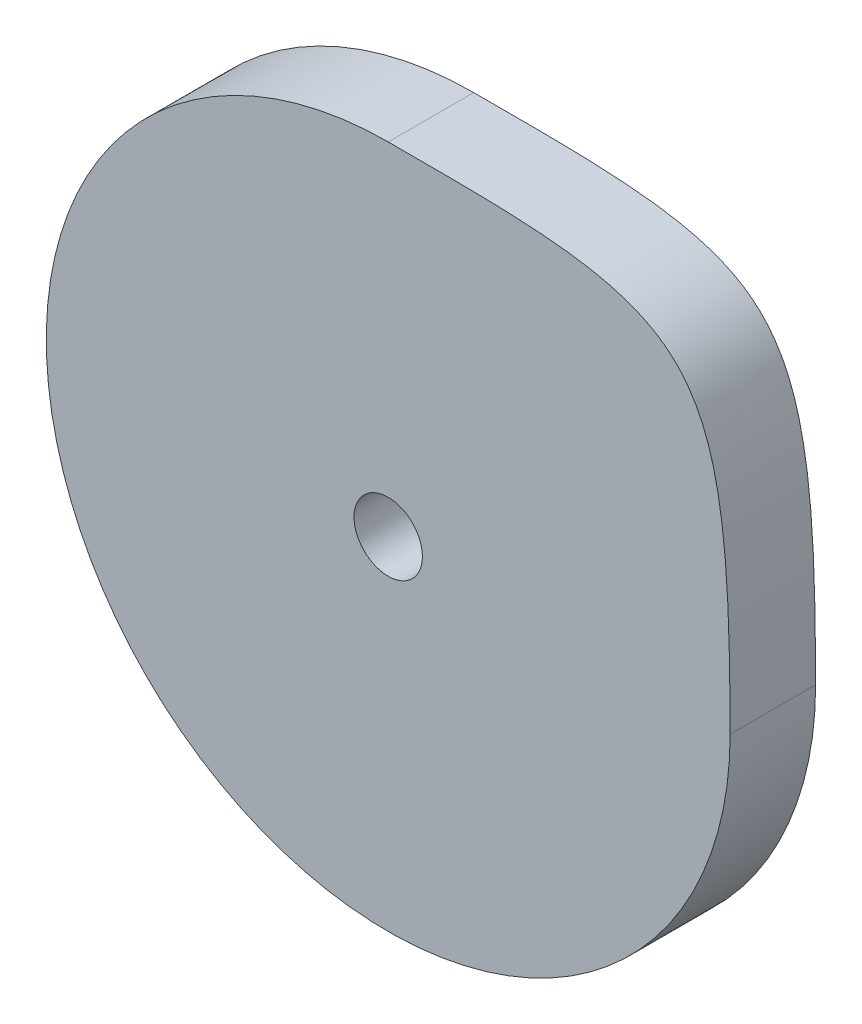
ISO-10303-21;
HEADER;
FILE_DESCRIPTION(('STEP AP214'),'2;1');
FILE_NAME('part.step','',(''),(''),'','','');
FILE_SCHEMA(('AUTOMOTIVE_DESIGN { 1 0 10303 214 1 1 1 1 }'));
ENDSEC;
DATA;
#1=APPLICATION_CONTEXT('core data for automotive mechanical design processes');
#2=APPLICATION_PROTOCOL_DEFINITION('international standard','automotive_design',2000,#1);
#3=PRODUCT_CONTEXT('',#1,'mechanical');
#4=PRODUCT('Part','Part','',(#3));
#5=PRODUCT_RELATED_PRODUCT_CATEGORY('part','',(#4));
#6=PRODUCT_DEFINITION_FORMATION('','',#4);
#7=PRODUCT_DEFINITION_CONTEXT('part definition',#1,'design');
#8=PRODUCT_DEFINITION('design','',#6,#7);
#9=PRODUCT_DEFINITION_SHAPE('','',#8);
#10=(LENGTH_UNIT() NAMED_UNIT(*) SI_UNIT(.MILLI.,.METRE.));
#11=(NAMED_UNIT(*) PLANE_ANGLE_UNIT() SI_UNIT($,.RADIAN.));
#12=(NAMED_UNIT(*) SI_UNIT($,.STERADIAN.) SOLID_ANGLE_UNIT());
#13=UNCERTAINTY_MEASURE_WITH_UNIT(LENGTH_MEASURE(1.E-05),#10,'distance_accuracy_value','');
#14=(GEOMETRIC_REPRESENTATION_CONTEXT(3) GLOBAL_UNCERTAINTY_ASSIGNED_CONTEXT((#13)) GLOBAL_UNIT_ASSIGNED_CONTEXT((#10,
#11,#12)) REPRESENTATION_CONTEXT('',''));
#15=CARTESIAN_POINT('',(0.,0.,0.));
#16=DIRECTION('',(0.,0.,1.));
#17=DIRECTION('',(1.,0.,0.));
#18=AXIS2_PLACEMENT_3D('',#15,#16,#17);
#19=CARTESIAN_POINT('',(32.7692127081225,35.2422942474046,10.));
#20=DIRECTION('',(0.,0.,-1.));
#21=DIRECTION('',(-1.,0.,0.));
#22=AXIS2_PLACEMENT_3D('',#19,#20,#21);
#23=PLANE('',#22);
#24=CARTESIAN_POINT('',(40.,0.,10.));
#25=CARTESIAN_POINT('',(40.,22.2918580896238,10.));
#26=CARTESIAN_POINT('',(37.3343437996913,40.2598451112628,10.));
#27=CARTESIAN_POINT('',(14.1486497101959,40.,10.));
#28=CARTESIAN_POINT('',(0.,40.,10.));
#29=B_SPLINE_CURVE_WITH_KNOTS('',3,(#24,#25,#26,#27,#28),.UNSPECIFIED.,.F.,.F.,(4,1,4),(0.,
0.54697590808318,1.),.UNSPECIFIED.);
#30=CARTESIAN_POINT('',(40.,0.,10.));
#31=VERTEX_POINT('',#30);
#32=CARTESIAN_POINT('',(0.,40.,10.));
#33=VERTEX_POINT('',#32);
#34=EDGE_CURVE('E65',#31,#33,#29,.T.);
#35=ORIENTED_EDGE('',*,*,#34,.T.);
#36=CARTESIAN_POINT('',(0.,0.,10.));
#37=DIRECTION('',(0.,0.,1.));
#38=DIRECTION('',(1.,0.,0.));
#39=AXIS2_PLACEMENT_3D('',#36,#37,#38);
#40=CIRCLE('',#39,40.);
#41=EDGE_CURVE('E50',#33,#31,#40,.T.);
#42=ORIENTED_EDGE('',*,*,#41,.T.);
#43=EDGE_LOOP('',(#35,#42));
#44=FACE_BOUND('',#43,.T.);
#45=CARTESIAN_POINT('',(0.,0.,10.));
#46=DIRECTION('',(0.,0.,1.));
#47=DIRECTION('',(1.,0.,0.));
#48=AXIS2_PLACEMENT_3D('',#45,#46,#47);
#49=CIRCLE('',#48,4.);
#50=CARTESIAN_POINT('',(4.,0.,10.));
#51=VERTEX_POINT('',#50);
#52=EDGE_CURVE('E71',#51,#51,#49,.T.);
#53=ORIENTED_EDGE('',*,*,#52,.F.);
#54=EDGE_LOOP('',(#53));
#55=FACE_BOUND('',#54,.T.);
#56=ADVANCED_FACE('F33',(#44,#55),#23,.F.);
#57=CARTESIAN_POINT('',(32.7692127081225,35.2422942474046,0.));
#58=DIRECTION('',(0.,0.,-1.));
#59=DIRECTION('',(-1.,0.,0.));
#60=AXIS2_PLACEMENT_3D('',#57,#58,#59);
#61=PLANE('',#60);
#62=CARTESIAN_POINT('',(40.,0.,0.));
#63=CARTESIAN_POINT('',(40.,22.2918580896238,0.));
#64=CARTESIAN_POINT('',(37.3343437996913,40.2598451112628,0.));
#65=CARTESIAN_POINT('',(14.1486497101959,40.,0.));
#66=CARTESIAN_POINT('',(0.,40.,0.));
#67=B_SPLINE_CURVE_WITH_KNOTS('',3,(#62,#63,#64,#65,#66),.UNSPECIFIED.,.F.,.F.,(4,1,4),(0.,
0.54697590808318,1.),.UNSPECIFIED.);
#68=CARTESIAN_POINT('',(40.,0.,0.));
#69=VERTEX_POINT('',#68);
#70=CARTESIAN_POINT('',(0.,40.,0.));
#71=VERTEX_POINT('',#70);
#72=EDGE_CURVE('E66',#69,#71,#67,.T.);
#73=ORIENTED_EDGE('',*,*,#72,.F.);
#74=CARTESIAN_POINT('',(0.,0.,0.));
#75=DIRECTION('',(0.,0.,1.));
#76=DIRECTION('',(1.,0.,0.));
#77=AXIS2_PLACEMENT_3D('',#74,#75,#76);
#78=CIRCLE('',#77,40.);
#79=EDGE_CURVE('E58',#71,#69,#78,.T.);
#80=ORIENTED_EDGE('',*,*,#79,.F.);
#81=EDGE_LOOP('',(#73,#80));
#82=FACE_BOUND('',#81,.T.);
#83=CARTESIAN_POINT('',(0.,0.,0.));
#84=DIRECTION('',(0.,0.,1.));
#85=DIRECTION('',(1.,0.,0.));
#86=AXIS2_PLACEMENT_3D('',#83,#84,#85);
#87=CIRCLE('',#86,4.);
#88=CARTESIAN_POINT('',(4.,0.,0.));
#89=VERTEX_POINT('',#88);
#90=EDGE_CURVE('E74',#89,#89,#87,.T.);
#91=ORIENTED_EDGE('',*,*,#90,.T.);
#92=EDGE_LOOP('',(#91));
#93=FACE_BOUND('',#92,.T.);
#94=ADVANCED_FACE('F69',(#82,#93),#61,.T.);
#95=DIRECTION('',(0.,0.,-1.));
#96=VECTOR('',#95,1.);
#97=SURFACE_OF_LINEAR_EXTRUSION('',#29,#96);
#98=ORIENTED_EDGE('',*,*,#72,.T.);
#99=DIRECTION('',(0.,0.,-1.));
#100=VECTOR('',#99,1.);
#101=CARTESIAN_POINT('',(0.,40.,10.));
#102=LINE('',#101,#100);
#103=EDGE_CURVE('E11',#33,#71,#102,.T.);
#104=ORIENTED_EDGE('',*,*,#103,.F.);
#105=ORIENTED_EDGE('',*,*,#34,.F.);
#106=DIRECTION('',(0.,0.,-1.));
#107=VECTOR('',#106,1.);
#108=CARTESIAN_POINT('',(40.,0.,10.));
#109=LINE('',#108,#107);
#110=EDGE_CURVE('E43',#31,#69,#109,.T.);
#111=ORIENTED_EDGE('',*,*,#110,.T.);
#112=EDGE_LOOP('',(#98,#104,#105,#111));
#113=FACE_BOUND('',#112,.T.);
#114=ADVANCED_FACE('F35',(#113),#97,.F.);
#115=CARTESIAN_POINT('',(0.,0.,10.));
#116=DIRECTION('',(0.,0.,-1.));
#117=DIRECTION('',(-1.,0.,0.));
#118=AXIS2_PLACEMENT_3D('',#115,#116,#117);
#119=CYLINDRICAL_SURFACE('',#118,40.);
#120=ORIENTED_EDGE('',*,*,#79,.T.);
#121=ORIENTED_EDGE('',*,*,#110,.F.);
#122=ORIENTED_EDGE('',*,*,#41,.F.);
#123=ORIENTED_EDGE('',*,*,#103,.T.);
#124=EDGE_LOOP('',(#120,#121,#122,#123));
#125=FACE_BOUND('',#124,.T.);
#126=ADVANCED_FACE('F61',(#125),#119,.T.);
#127=CARTESIAN_POINT('',(0.,0.,10.));
#128=DIRECTION('',(0.,0.,-1.));
#129=DIRECTION('',(-1.,0.,0.));
#130=AXIS2_PLACEMENT_3D('',#127,#128,#129);
#131=CYLINDRICAL_SURFACE('',#130,4.);
#132=ORIENTED_EDGE('',*,*,#52,.T.);
#133=EDGE_LOOP('',(#132));
#134=FACE_BOUND('',#133,.T.);
#135=ORIENTED_EDGE('',*,*,#90,.F.);
#136=EDGE_LOOP('',(#135));
#137=FACE_BOUND('',#136,.T.);
#138=ADVANCED_FACE('F92',(#134,#137),#131,.F.);
#139=CLOSED_SHELL('',(#56,#94,#114,#126,#138));
#140=MANIFOLD_SOLID_BREP('B2',#139);
#141=ADVANCED_BREP_SHAPE_REPRESENTATION('',(#18,#140),#14);
#142=SHAPE_DEFINITION_REPRESENTATION(#9,#141);
ENDSEC;
END-ISO-10303-21;
